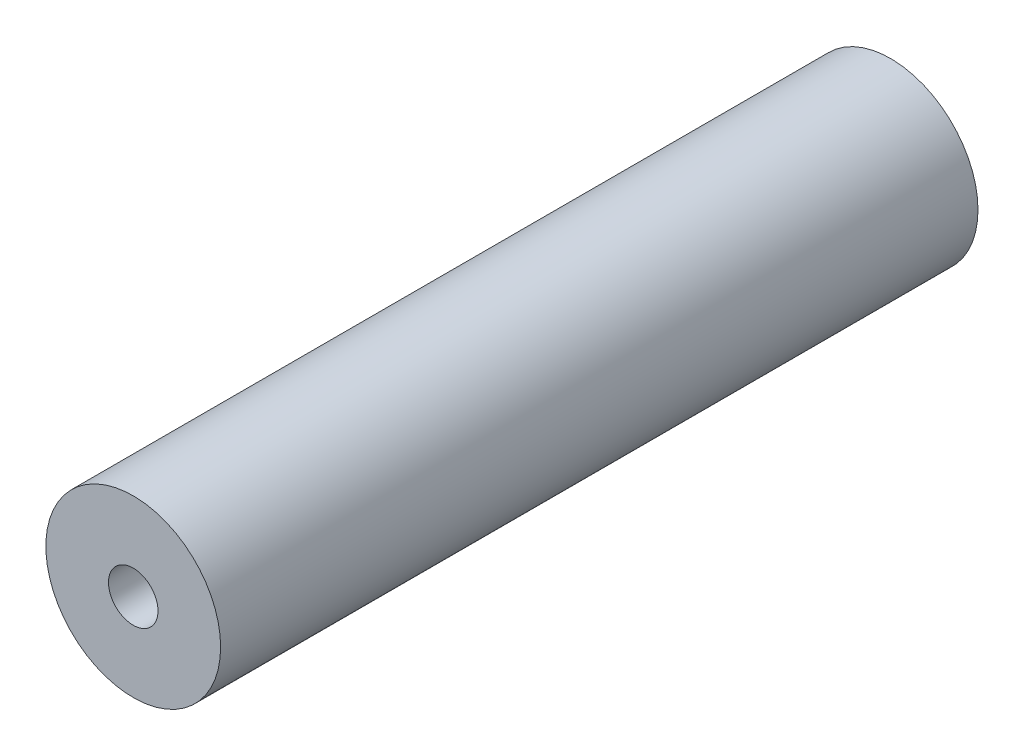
ISO-10303-21;
HEADER;
FILE_DESCRIPTION(('STEP AP214'),'2;1');
FILE_NAME('part.step','',(''),(''),'','','');
FILE_SCHEMA(('AUTOMOTIVE_DESIGN { 1 0 10303 214 1 1 1 1 }'));
ENDSEC;
DATA;
#1=APPLICATION_CONTEXT('core data for automotive mechanical design processes');
#2=APPLICATION_PROTOCOL_DEFINITION('international standard','automotive_design',2000,#1);
#3=PRODUCT_CONTEXT('',#1,'mechanical');
#4=PRODUCT('Part','Part','',(#3));
#5=PRODUCT_RELATED_PRODUCT_CATEGORY('part','',(#4));
#6=PRODUCT_DEFINITION_FORMATION('','',#4);
#7=PRODUCT_DEFINITION_CONTEXT('part definition',#1,'design');
#8=PRODUCT_DEFINITION('design','',#6,#7);
#9=PRODUCT_DEFINITION_SHAPE('','',#8);
#10=(LENGTH_UNIT() NAMED_UNIT(*) SI_UNIT(.MILLI.,.METRE.));
#11=(NAMED_UNIT(*) PLANE_ANGLE_UNIT() SI_UNIT($,.RADIAN.));
#12=(NAMED_UNIT(*) SI_UNIT($,.STERADIAN.) SOLID_ANGLE_UNIT());
#13=UNCERTAINTY_MEASURE_WITH_UNIT(LENGTH_MEASURE(1.E-05),#10,'distance_accuracy_value','');
#14=(GEOMETRIC_REPRESENTATION_CONTEXT(3) GLOBAL_UNCERTAINTY_ASSIGNED_CONTEXT((#13)) GLOBAL_UNIT_ASSIGNED_CONTEXT((#10,
#11,#12)) REPRESENTATION_CONTEXT('',''));
#15=CARTESIAN_POINT('',(0.,0.,0.));
#16=DIRECTION('',(0.,0.,1.));
#17=DIRECTION('',(1.,0.,0.));
#18=AXIS2_PLACEMENT_3D('',#15,#16,#17);
#19=CARTESIAN_POINT('',(0.,0.,130.));
#20=DIRECTION('',(0.,0.,-1.));
#21=DIRECTION('',(-1.,0.,0.));
#22=AXIS2_PLACEMENT_3D('',#19,#20,#21);
#23=CYLINDRICAL_SURFACE('',#22,15.);
#24=CARTESIAN_POINT('',(0.,0.,130.));
#25=DIRECTION('',(0.,0.,1.));
#26=DIRECTION('',(1.,0.,0.));
#27=AXIS2_PLACEMENT_3D('',#24,#25,#26);
#28=CIRCLE('',#27,15.);
#29=CARTESIAN_POINT('',(15.,0.,130.));
#30=VERTEX_POINT('',#29);
#31=EDGE_CURVE('E11',#30,#30,#28,.T.);
#32=ORIENTED_EDGE('',*,*,#31,.F.);
#33=EDGE_LOOP('',(#32));
#34=FACE_BOUND('',#33,.T.);
#35=CARTESIAN_POINT('',(0.,0.,0.));
#36=DIRECTION('',(0.,0.,1.));
#37=DIRECTION('',(1.,0.,0.));
#38=AXIS2_PLACEMENT_3D('',#35,#36,#37);
#39=CIRCLE('',#38,15.);
#40=CARTESIAN_POINT('',(15.,0.,0.));
#41=VERTEX_POINT('',#40);
#42=EDGE_CURVE('E50',#41,#41,#39,.T.);
#43=ORIENTED_EDGE('',*,*,#42,.T.);
#44=EDGE_LOOP('',(#43));
#45=FACE_BOUND('',#44,.T.);
#46=ADVANCED_FACE('F42',(#34,#45),#23,.T.);
#47=CARTESIAN_POINT('',(0.,0.,130.));
#48=DIRECTION('',(0.,0.,1.));
#49=DIRECTION('',(1.,0.,0.));
#50=AXIS2_PLACEMENT_3D('',#47,#48,#49);
#51=PLANE('',#50);
#52=CARTESIAN_POINT('',(0.,0.,130.));
#53=DIRECTION('',(0.,0.,1.));
#54=DIRECTION('',(1.,0.,0.));
#55=AXIS2_PLACEMENT_3D('',#52,#53,#54);
#56=CIRCLE('',#55,4.25);
#57=CARTESIAN_POINT('',(4.24999999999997,0.,130.));
#58=VERTEX_POINT('',#57);
#59=EDGE_CURVE('E77',#58,#58,#56,.T.);
#60=ORIENTED_EDGE('',*,*,#59,.F.);
#61=EDGE_LOOP('',(#60));
#62=FACE_BOUND('',#61,.T.);
#63=ORIENTED_EDGE('',*,*,#31,.T.);
#64=EDGE_LOOP('',(#63));
#65=FACE_BOUND('',#64,.T.);
#66=ADVANCED_FACE('F87',(#62,#65),#51,.T.);
#67=CARTESIAN_POINT('',(0.,0.,0.));
#68=DIRECTION('',(0.,0.,1.));
#69=DIRECTION('',(1.,0.,0.));
#70=AXIS2_PLACEMENT_3D('',#67,#68,#69);
#71=PLANE('',#70);
#72=CARTESIAN_POINT('',(0.,0.,0.));
#73=DIRECTION('',(0.,0.,-1.));
#74=DIRECTION('',(-1.,0.,0.));
#75=AXIS2_PLACEMENT_3D('',#72,#73,#74);
#76=CIRCLE('',#75,4.24999999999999);
#77=CARTESIAN_POINT('',(-4.24999999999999,0.,0.));
#78=VERTEX_POINT('',#77);
#79=EDGE_CURVE('E66',#78,#78,#76,.T.);
#80=ORIENTED_EDGE('',*,*,#79,.F.);
#81=EDGE_LOOP('',(#80));
#82=FACE_BOUND('',#81,.T.);
#83=ORIENTED_EDGE('',*,*,#42,.F.);
#84=EDGE_LOOP('',(#83));
#85=FACE_BOUND('',#84,.T.);
#86=ADVANCED_FACE('F84',(#82,#85),#71,.F.);
#87=CARTESIAN_POINT('',(0.,0.,130.));
#88=DIRECTION('',(0.,0.,1.));
#89=DIRECTION('',(1.,0.,0.));
#90=AXIS2_PLACEMENT_3D('',#87,#88,#89);
#91=CYLINDRICAL_SURFACE('',#90,4.25);
#92=CARTESIAN_POINT('',(0.,0.,100.5));
#93=DIRECTION('',(0.,0.,1.));
#94=DIRECTION('',(1.,0.,0.));
#95=AXIS2_PLACEMENT_3D('',#92,#93,#94);
#96=CIRCLE('',#95,4.24999999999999);
#97=CARTESIAN_POINT('',(4.24999999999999,0.,100.5));
#98=VERTEX_POINT('',#97);
#99=EDGE_CURVE('E71',#98,#98,#96,.T.);
#100=ORIENTED_EDGE('',*,*,#99,.F.);
#101=EDGE_LOOP('',(#100));
#102=FACE_BOUND('',#101,.T.);
#103=ORIENTED_EDGE('',*,*,#59,.T.);
#104=EDGE_LOOP('',(#103));
#105=FACE_BOUND('',#104,.T.);
#106=ADVANCED_FACE('F86',(#102,#105),#91,.F.);
#107=CARTESIAN_POINT('',(0.,0.,100.5));
#108=DIRECTION('',(0.,0.,1.));
#109=DIRECTION('',(1.,0.,0.));
#110=AXIS2_PLACEMENT_3D('',#107,#108,#109);
#111=CONICAL_SURFACE('',#110,4.24999999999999,1.02974425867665);
#112=CARTESIAN_POINT('',(0.,0.,97.9463423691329));
#113=VERTEX_POINT('',#112);
#114=VERTEX_LOOP('',#113);
#115=FACE_BOUND('',#114,.T.);
#116=ORIENTED_EDGE('',*,*,#99,.T.);
#117=EDGE_LOOP('',(#116));
#118=FACE_BOUND('',#117,.T.);
#119=ADVANCED_FACE('F94',(#115,#118),#111,.F.);
#120=CARTESIAN_POINT('',(0.,0.,0.));
#121=DIRECTION('',(0.,0.,-1.));
#122=DIRECTION('',(-1.,0.,0.));
#123=AXIS2_PLACEMENT_3D('',#120,#121,#122);
#124=CYLINDRICAL_SURFACE('',#123,4.24999999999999);
#125=CARTESIAN_POINT('',(0.,0.,29.5));
#126=DIRECTION('',(0.,0.,-1.));
#127=DIRECTION('',(-1.,0.,0.));
#128=AXIS2_PLACEMENT_3D('',#125,#126,#127);
#129=CIRCLE('',#128,4.24999999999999);
#130=CARTESIAN_POINT('',(-4.24999999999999,0.,29.5));
#131=VERTEX_POINT('',#130);
#132=EDGE_CURVE('E63',#131,#131,#129,.T.);
#133=ORIENTED_EDGE('',*,*,#132,.F.);
#134=EDGE_LOOP('',(#133));
#135=FACE_BOUND('',#134,.T.);
#136=ORIENTED_EDGE('',*,*,#79,.T.);
#137=EDGE_LOOP('',(#136));
#138=FACE_BOUND('',#137,.T.);
#139=ADVANCED_FACE('F59',(#135,#138),#124,.F.);
#140=CARTESIAN_POINT('',(0.,0.,29.5));
#141=DIRECTION('',(0.,0.,-1.));
#142=DIRECTION('',(-1.,0.,0.));
#143=AXIS2_PLACEMENT_3D('',#140,#141,#142);
#144=CONICAL_SURFACE('',#143,4.24999999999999,1.02974425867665);
#145=CARTESIAN_POINT('',(0.,0.,32.0536576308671));
#146=VERTEX_POINT('',#145);
#147=VERTEX_LOOP('',#146);
#148=FACE_BOUND('',#147,.T.);
#149=ORIENTED_EDGE('',*,*,#132,.T.);
#150=EDGE_LOOP('',(#149));
#151=FACE_BOUND('',#150,.T.);
#152=ADVANCED_FACE('F56',(#148,#151),#144,.F.);
#153=CLOSED_SHELL('',(#46,#66,#86,#106,#119,#139,#152));
#154=MANIFOLD_SOLID_BREP('B2',#153);
#155=ADVANCED_BREP_SHAPE_REPRESENTATION('',(#18,#154),#14);
#156=SHAPE_DEFINITION_REPRESENTATION(#9,#155);
ENDSEC;
END-ISO-10303-21;
